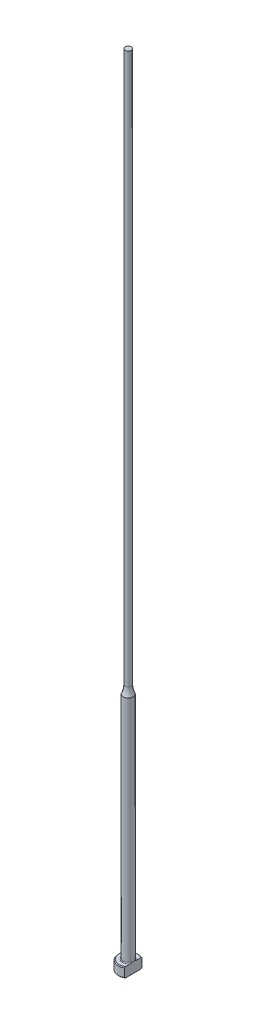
ISO-10303-21;
HEADER;
FILE_DESCRIPTION(('STEP AP214'),'2;1');
FILE_NAME('part.step','',(''),(''),'','','');
FILE_SCHEMA(('AUTOMOTIVE_DESIGN { 1 0 10303 214 1 1 1 1 }'));
ENDSEC;
DATA;
#1=APPLICATION_CONTEXT('core data for automotive mechanical design processes');
#2=APPLICATION_PROTOCOL_DEFINITION('international standard','automotive_design',2000,#1);
#3=PRODUCT_CONTEXT('',#1,'mechanical');
#4=PRODUCT('Part','Part','',(#3));
#5=PRODUCT_RELATED_PRODUCT_CATEGORY('part','',(#4));
#6=PRODUCT_DEFINITION_FORMATION('','',#4);
#7=PRODUCT_DEFINITION_CONTEXT('part definition',#1,'design');
#8=PRODUCT_DEFINITION('design','',#6,#7);
#9=PRODUCT_DEFINITION_SHAPE('','',#8);
#10=(LENGTH_UNIT() NAMED_UNIT(*) SI_UNIT(.MILLI.,.METRE.));
#11=(NAMED_UNIT(*) PLANE_ANGLE_UNIT() SI_UNIT($,.RADIAN.));
#12=(NAMED_UNIT(*) SI_UNIT($,.STERADIAN.) SOLID_ANGLE_UNIT());
#13=UNCERTAINTY_MEASURE_WITH_UNIT(LENGTH_MEASURE(1.E-05),#10,'distance_accuracy_value','');
#14=(GEOMETRIC_REPRESENTATION_CONTEXT(3) GLOBAL_UNCERTAINTY_ASSIGNED_CONTEXT((#13)) GLOBAL_UNIT_ASSIGNED_CONTEXT((#10,
#11,#12)) REPRESENTATION_CONTEXT('',''));
#15=CARTESIAN_POINT('',(0.,0.,0.));
#16=DIRECTION('',(0.,0.,1.));
#17=DIRECTION('',(1.,0.,0.));
#18=AXIS2_PLACEMENT_3D('',#15,#16,#17);
#19=CARTESIAN_POINT('',(-3.17499999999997,3.175,0.));
#20=DIRECTION('',(0.,1.,0.));
#21=DIRECTION('',(0.,0.,1.));
#22=AXIS2_PLACEMENT_3D('',#19,#20,#21);
#23=PLANE('',#22);
#24=CARTESIAN_POINT('',(0.,3.175,0.));
#25=DIRECTION('',(0.,1.,0.));
#26=DIRECTION('',(0.,0.,1.));
#27=AXIS2_PLACEMENT_3D('',#24,#25,#26);
#28=CIRCLE('',#27,2.92099999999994);
#29=CARTESIAN_POINT('',(1.58749999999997,3.175,-2.45195529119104));
#30=VERTEX_POINT('',#29);
#31=CARTESIAN_POINT('',(1.58749999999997,3.175,2.45195529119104));
#32=VERTEX_POINT('',#31);
#33=EDGE_CURVE('E105',#30,#32,#28,.T.);
#34=ORIENTED_EDGE('',*,*,#33,.T.);
#35=DIRECTION('',(0.,0.,1.));
#36=VECTOR('',#35,1.);
#37=CARTESIAN_POINT('',(1.58749999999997,3.17499999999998,2.74963065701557));
#38=LINE('',#37,#36);
#39=CARTESIAN_POINT('',(1.58749999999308,3.175,0.933255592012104));
#40=VERTEX_POINT('',#39);
#41=EDGE_CURVE('E126',#40,#32,#38,.T.);
#42=ORIENTED_EDGE('',*,*,#41,.F.);
#43=CARTESIAN_POINT('',(0.,3.175,0.));
#44=DIRECTION('',(0.,1.,0.));
#45=DIRECTION('',(0.,0.,1.));
#46=AXIS2_PLACEMENT_3D('',#43,#44,#45);
#47=CIRCLE('',#46,1.84149999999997);
#48=CARTESIAN_POINT('',(1.58749999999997,3.17500000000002,-0.933255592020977));
#49=VERTEX_POINT('',#48);
#50=EDGE_CURVE('E11',#40,#49,#47,.F.);
#51=ORIENTED_EDGE('',*,*,#50,.T.);
#52=EDGE_CURVE('E52',#30,#49,#38,.T.);
#53=ORIENTED_EDGE('',*,*,#52,.F.);
#54=EDGE_LOOP('',(#34,#42,#51,#53));
#55=FACE_BOUND('',#54,.T.);
#56=ADVANCED_FACE('F32',(#55),#23,.T.);
#57=CARTESIAN_POINT('',(0.,259.958771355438,0.));
#58=DIRECTION('',(0.,1.,0.));
#59=DIRECTION('',(0.,0.,1.));
#60=AXIS2_PLACEMENT_3D('',#57,#58,#59);
#61=CYLINDRICAL_SURFACE('',#60,3.17499999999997);
#62=CARTESIAN_POINT('',(0.,2.92100000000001,0.));
#63=DIRECTION('',(0.,1.,0.));
#64=DIRECTION('',(0.,0.,1.));
#65=AXIS2_PLACEMENT_3D('',#62,#63,#64);
#66=CIRCLE('',#65,3.17499999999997);
#67=CARTESIAN_POINT('',(1.58749999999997,2.92100000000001,2.74963065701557));
#68=VERTEX_POINT('',#67);
#69=CARTESIAN_POINT('',(1.58749999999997,2.92100000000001,-2.74963065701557));
#70=VERTEX_POINT('',#69);
#71=EDGE_CURVE('E98',#68,#70,#66,.F.);
#72=ORIENTED_EDGE('',*,*,#71,.T.);
#73=DIRECTION('',(0.,-1.,0.));
#74=VECTOR('',#73,1.);
#75=CARTESIAN_POINT('',(1.58749999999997,254.001,-2.74963065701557));
#76=LINE('',#75,#74);
#77=CARTESIAN_POINT('',(1.58749999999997,0.253999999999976,-2.74963065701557));
#78=VERTEX_POINT('',#77);
#79=EDGE_CURVE('E141',#70,#78,#76,.T.);
#80=ORIENTED_EDGE('',*,*,#79,.T.);
#81=CARTESIAN_POINT('',(0.,0.253999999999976,0.));
#82=DIRECTION('',(0.,-1.,0.));
#83=DIRECTION('',(0.,0.,-1.));
#84=AXIS2_PLACEMENT_3D('',#81,#82,#83);
#85=CIRCLE('',#84,3.17499999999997);
#86=CARTESIAN_POINT('',(1.58749999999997,0.253999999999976,2.74963065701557));
#87=VERTEX_POINT('',#86);
#88=EDGE_CURVE('E95',#78,#87,#85,.F.);
#89=ORIENTED_EDGE('',*,*,#88,.T.);
#90=DIRECTION('',(0.,-1.,0.));
#91=VECTOR('',#90,1.);
#92=CARTESIAN_POINT('',(1.58749999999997,254.001,2.74963065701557));
#93=LINE('',#92,#91);
#94=EDGE_CURVE('E88',#68,#87,#93,.T.);
#95=ORIENTED_EDGE('',*,*,#94,.F.);
#96=EDGE_LOOP('',(#72,#80,#89,#95));
#97=FACE_BOUND('',#96,.T.);
#98=ADVANCED_FACE('F191',(#97),#61,.T.);
#99=CARTESIAN_POINT('',(0.,0.,0.));
#100=DIRECTION('',(0.,-1.,0.));
#101=DIRECTION('',(0.,0.,-1.));
#102=AXIS2_PLACEMENT_3D('',#99,#100,#101);
#103=PLANE('',#102);
#104=CARTESIAN_POINT('',(0.,0.,0.));
#105=DIRECTION('',(0.,-1.,0.));
#106=DIRECTION('',(0.,0.,-1.));
#107=AXIS2_PLACEMENT_3D('',#104,#105,#106);
#108=CIRCLE('',#107,2.92100000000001);
#109=CARTESIAN_POINT('',(1.58749999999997,0.,2.45195529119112));
#110=VERTEX_POINT('',#109);
#111=CARTESIAN_POINT('',(1.58749999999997,0.,-2.45195529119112));
#112=VERTEX_POINT('',#111);
#113=EDGE_CURVE('E93',#110,#112,#108,.T.);
#114=ORIENTED_EDGE('',*,*,#113,.T.);
#115=DIRECTION('',(0.,0.,1.));
#116=VECTOR('',#115,1.);
#117=CARTESIAN_POINT('',(1.58749999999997,0.,2.74963065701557));
#118=LINE('',#117,#116);
#119=EDGE_CURVE('E78',#112,#110,#118,.T.);
#120=ORIENTED_EDGE('',*,*,#119,.T.);
#121=EDGE_LOOP('',(#114,#120));
#122=FACE_BOUND('',#121,.T.);
#123=ADVANCED_FACE('F97',(#122),#103,.T.);
#124=CARTESIAN_POINT('',(0.,3.17499999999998,0.));
#125=DIRECTION('',(0.,-1.,0.));
#126=DIRECTION('',(0.,0.,-1.));
#127=AXIS2_PLACEMENT_3D('',#124,#125,#126);
#128=CONICAL_SURFACE('',#127,2.92099999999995,0.785398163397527);
#129=ORIENTED_EDGE('',*,*,#71,.F.);
#130=CARTESIAN_POINT('',(1.58749999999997,-0.16162066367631,-6.0529050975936));
#131=CARTESIAN_POINT('',(1.58749999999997,-0.0288893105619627,-5.91567682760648));
#132=CARTESIAN_POINT('',(1.58749999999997,0.103699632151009,-5.7783103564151));
#133=CARTESIAN_POINT('',(1.58749999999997,0.368508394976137,-5.50321874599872));
#134=CARTESIAN_POINT('',(1.58749999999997,0.500728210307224,-5.36549360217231));
#135=CARTESIAN_POINT('',(1.58749999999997,0.764778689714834,-5.08953516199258));
#136=CARTESIAN_POINT('',(1.58749999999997,0.896609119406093,-4.9513016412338));
#137=CARTESIAN_POINT('',(1.58749999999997,1.15968706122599,-4.67428233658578));
#138=CARTESIAN_POINT('',(1.58749999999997,1.29093457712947,-4.53549655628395));
#139=CARTESIAN_POINT('',(1.58749999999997,1.55007705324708,-4.25997724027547));
#140=CARTESIAN_POINT('',(1.58749999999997,1.67798684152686,-4.12325766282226));
#141=CARTESIAN_POINT('',(1.58749999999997,1.9328486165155,-3.84892898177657));
#142=CARTESIAN_POINT('',(1.58749999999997,2.05980060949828,-3.71131988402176));
#143=CARTESIAN_POINT('',(1.58749999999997,2.31237508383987,-3.43493978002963));
#144=CARTESIAN_POINT('',(1.58749999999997,2.43799784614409,-3.29616903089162));
#145=CARTESIAN_POINT('',(1.58749999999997,2.68741369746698,-3.01699558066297));
#146=CARTESIAN_POINT('',(1.58749999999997,2.81120686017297,-2.8765929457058));
#147=CARTESIAN_POINT('',(1.58749999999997,3.00875865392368,-2.64816703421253));
#148=CARTESIAN_POINT('',(1.58749999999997,3.08336151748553,-2.56087478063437));
#149=CARTESIAN_POINT('',(1.58749999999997,3.2312387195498,-2.38515423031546));
#150=CARTESIAN_POINT('',(1.58749999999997,3.30451292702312,-2.29672582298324));
#151=CARTESIAN_POINT('',(1.58749999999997,3.45004422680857,-2.1174740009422));
#152=CARTESIAN_POINT('',(1.58749999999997,3.5222823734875,-2.02663514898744));
#153=CARTESIAN_POINT('',(1.58749999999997,3.66423097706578,-1.8430252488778));
#154=CARTESIAN_POINT('',(1.58749999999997,3.73394203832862,-1.75025467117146));
#155=CARTESIAN_POINT('',(1.58749999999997,3.87080633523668,-1.5606747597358));
#156=CARTESIAN_POINT('',(1.58749999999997,3.93790459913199,-1.46382547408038));
#157=CARTESIAN_POINT('',(1.58749999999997,4.06669147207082,-1.26632594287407));
#158=CARTESIAN_POINT('',(1.58749999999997,4.1283726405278,-1.16567073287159));
#159=CARTESIAN_POINT('',(1.58749999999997,4.21402252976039,-1.01165766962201));
#160=CARTESIAN_POINT('',(1.58749999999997,4.24127929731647,-0.960142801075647));
#161=CARTESIAN_POINT('',(1.58749999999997,4.2930979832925,-0.855780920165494));
#162=CARTESIAN_POINT('',(1.58749999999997,4.31765941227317,-0.802933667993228));
#163=CARTESIAN_POINT('',(1.58749999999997,4.38614656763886,-0.642461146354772));
#164=CARTESIAN_POINT('',(1.58749999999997,4.42510149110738,-0.532518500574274));
#165=CARTESIAN_POINT('',(1.58749999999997,4.46726244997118,-0.367680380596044));
#166=CARTESIAN_POINT('',(1.58749999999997,4.47844427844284,-0.314802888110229));
#167=CARTESIAN_POINT('',(1.58749999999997,4.49576654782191,-0.208209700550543));
#168=CARTESIAN_POINT('',(1.58749999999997,4.50190743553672,-0.154494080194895));
#169=CARTESIAN_POINT('',(1.58749999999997,4.50871296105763,-0.0468792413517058));
#170=CARTESIAN_POINT('',(1.58749999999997,4.5093945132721,0.00701889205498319));
#171=CARTESIAN_POINT('',(1.58749999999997,4.50527679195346,0.114606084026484));
#172=CARTESIAN_POINT('',(1.58749999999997,4.50047706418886,0.168295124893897));
#173=CARTESIAN_POINT('',(1.58749999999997,4.48579689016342,0.27448544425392));
#174=CARTESIAN_POINT('',(1.58749999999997,4.47596081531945,0.32699298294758));
#175=CARTESIAN_POINT('',(1.58749999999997,4.45181809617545,0.430974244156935));
#176=CARTESIAN_POINT('',(1.58749999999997,4.4375096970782,0.482447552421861));
#177=CARTESIAN_POINT('',(1.58749999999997,4.40502489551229,0.584460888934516));
#178=CARTESIAN_POINT('',(1.58749999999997,4.386827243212,0.634994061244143));
#179=CARTESIAN_POINT('',(1.58749999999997,4.34729308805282,0.734789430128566));
#180=CARTESIAN_POINT('',(1.58749999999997,4.3259572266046,0.784051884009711));
#181=CARTESIAN_POINT('',(1.58749999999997,4.25791922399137,0.930549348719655));
#182=CARTESIAN_POINT('',(1.58749999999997,4.20736047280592,1.0259880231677));
#183=CARTESIAN_POINT('',(1.58749999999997,4.0995545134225,1.21304313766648));
#184=CARTESIAN_POINT('',(1.58749999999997,4.04229912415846,1.30465471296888));
#185=CARTESIAN_POINT('',(1.58749999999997,3.92308746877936,1.48526211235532));
#186=CARTESIAN_POINT('',(1.58749999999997,3.86111349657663,1.57424615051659));
#187=CARTESIAN_POINT('',(1.58749999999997,3.73408621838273,1.74990003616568));
#188=CARTESIAN_POINT('',(1.58749999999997,3.66903444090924,1.83657099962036));
#189=CARTESIAN_POINT('',(1.58749999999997,3.53583371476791,2.00931764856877));
#190=CARTESIAN_POINT('',(1.58749999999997,3.46765527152,2.09537048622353));
#191=CARTESIAN_POINT('',(1.58749999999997,3.32960643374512,2.26611736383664));
#192=CARTESIAN_POINT('',(1.58749999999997,3.25973586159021,2.35081125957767));
#193=CARTESIAN_POINT('',(1.58749999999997,3.04858139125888,2.60290121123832));
#194=CARTESIAN_POINT('',(1.58749999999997,2.90542388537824,2.76872537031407));
#195=CARTESIAN_POINT('',(1.58749999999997,2.64069522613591,3.06970913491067));
#196=CARTESIAN_POINT('',(1.58749999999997,2.51959458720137,3.20528660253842));
#197=CARTESIAN_POINT('',(1.58749999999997,2.27590400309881,3.47510321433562));
#198=CARTESIAN_POINT('',(1.58749999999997,2.15331401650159,3.60934232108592));
#199=CARTESIAN_POINT('',(1.58749999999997,1.90694239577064,3.87695374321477));
#200=CARTESIAN_POINT('',(1.58749999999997,1.78315974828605,4.0103251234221));
#201=CARTESIAN_POINT('',(1.58749999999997,1.53478104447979,4.27630880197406));
#202=CARTESIAN_POINT('',(1.58749999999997,1.41018498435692,4.40892109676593));
#203=CARTESIAN_POINT('',(1.58749999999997,1.0457468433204,4.79499418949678));
#204=CARTESIAN_POINT('',(1.58749999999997,0.80507680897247,5.04767313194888));
#205=CARTESIAN_POINT('',(1.58749999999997,0.443121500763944,5.42550911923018));
#206=CARTESIAN_POINT('',(1.58749999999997,0.322378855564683,5.55118772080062));
#207=CARTESIAN_POINT('',(1.58749999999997,0.0805914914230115,5.80225207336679));
#208=CARTESIAN_POINT('',(1.58749999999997,-0.040453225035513,5.92763782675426));
#209=CARTESIAN_POINT('',(1.58749999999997,-0.161620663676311,6.0529050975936));
#210=B_SPLINE_CURVE_WITH_KNOTS('',3,(#130,#131,#132,#133,#134,#135,#136,#137,#138,#139,#140,
#141,#142,#143,#144,#145,#146,#147,#148,#149,#150,#151,#152,#153,#154,#155,#156,#157,#158,#159,
#160,#161,#162,#163,#164,#165,#166,#167,#168,#169,#170,#171,#172,#173,#174,#175,#176,#177,#178,
#179,#180,#181,#182,#183,#184,#185,#186,#187,#188,#189,#190,#191,#192,#193,#194,#195,#196,#197,
#198,#199,#200,#201,#202,#203,#204,#205,#206,#207,#208,#209),.UNSPECIFIED.,.F.,.F.,(4,2,2,2,2,2,
2,2,2,2,2,2,2,2,2,2,2,2,2,2,2,2,2,2,2,2,2,2,2,2,2,2,2,2,2,2,2,2,2,4),(0.,0.572750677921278,
1.14550874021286,1.71856057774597,2.29160869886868,2.85328006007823,3.4149477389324,
3.97649423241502,4.53801804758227,4.88249307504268,5.22700189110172,5.5751532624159,
5.92322081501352,6.27657800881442,6.63041319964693,6.80518126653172,6.9799810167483,
7.3282426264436,7.49018491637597,7.65211285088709,7.81353889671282,7.97497832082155,
8.13501929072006,8.29512313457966,8.45612518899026,8.61709438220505,8.94062993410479,
9.2645649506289,9.58978187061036,9.91483894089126,10.2441741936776,10.5735441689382,
11.2306812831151,11.7760337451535,12.3214014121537,12.8672825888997,13.4131663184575,
14.4600164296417,14.9828595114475,15.5056983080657),.UNSPECIFIED.);
#211=EDGE_CURVE('E118',#32,#68,#210,.T.);
#212=ORIENTED_EDGE('',*,*,#211,.F.);
#213=ORIENTED_EDGE('',*,*,#33,.F.);
#214=EDGE_CURVE('E117',#70,#30,#210,.T.);
#215=ORIENTED_EDGE('',*,*,#214,.F.);
#216=EDGE_LOOP('',(#129,#212,#213,#215));
#217=FACE_BOUND('',#216,.T.);
#218=ADVANCED_FACE('F162',(#217),#128,.T.);
#219=CARTESIAN_POINT('',(0.,0.253999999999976,0.));
#220=DIRECTION('',(0.,1.,0.));
#221=DIRECTION('',(0.,0.,1.));
#222=AXIS2_PLACEMENT_3D('',#219,#220,#221);
#223=CONICAL_SURFACE('',#222,3.17499999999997,0.785398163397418);
#224=ORIENTED_EDGE('',*,*,#88,.F.);
#225=CARTESIAN_POINT('',(1.58749999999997,3.33662066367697,6.0529050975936));
#226=CARTESIAN_POINT('',(1.58749999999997,3.20388931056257,5.91567682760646));
#227=CARTESIAN_POINT('',(1.58749999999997,3.07130036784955,5.77831035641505));
#228=CARTESIAN_POINT('',(1.58749999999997,2.80649160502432,5.50321874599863));
#229=CARTESIAN_POINT('',(1.58749999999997,2.67427178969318,5.3654936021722));
#230=CARTESIAN_POINT('',(1.58749999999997,2.41022131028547,5.08953516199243));
#231=CARTESIAN_POINT('',(1.58749999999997,2.27839088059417,4.95130164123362));
#232=CARTESIAN_POINT('',(1.58749999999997,2.01531293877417,4.67428233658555));
#233=CARTESIAN_POINT('',(1.58749999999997,1.88406542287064,4.5354965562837));
#234=CARTESIAN_POINT('',(1.58749999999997,1.62492294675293,4.25997724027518));
#235=CARTESIAN_POINT('',(1.58749999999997,1.49701315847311,4.12325766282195));
#236=CARTESIAN_POINT('',(1.58749999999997,1.24215138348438,3.84892898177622));
#237=CARTESIAN_POINT('',(1.58749999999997,1.11519939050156,3.71131988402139));
#238=CARTESIAN_POINT('',(1.58749999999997,0.862624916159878,3.43493978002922));
#239=CARTESIAN_POINT('',(1.58749999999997,0.737002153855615,3.29616903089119));
#240=CARTESIAN_POINT('',(1.58749999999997,0.487586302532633,3.01699558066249));
#241=CARTESIAN_POINT('',(1.58749999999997,0.363793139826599,2.8765929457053));
#242=CARTESIAN_POINT('',(1.58749999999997,0.166241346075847,2.64816703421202));
#243=CARTESIAN_POINT('',(1.58749999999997,0.0916384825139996,2.56087478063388));
#244=CARTESIAN_POINT('',(1.58749999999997,-0.0562387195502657,2.385154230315));
#245=CARTESIAN_POINT('',(1.58749999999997,-0.129512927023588,2.29672582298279));
#246=CARTESIAN_POINT('',(1.58749999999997,-0.27504422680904,2.11747400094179));
#247=CARTESIAN_POINT('',(1.58749999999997,-0.347282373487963,2.02663514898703));
#248=CARTESIAN_POINT('',(1.58749999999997,-0.489230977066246,1.84302524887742));
#249=CARTESIAN_POINT('',(1.58749999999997,-0.558942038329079,1.7502546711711));
#250=CARTESIAN_POINT('',(1.58749999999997,-0.695806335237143,1.56067475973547));
#251=CARTESIAN_POINT('',(1.58749999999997,-0.762904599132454,1.46382547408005));
#252=CARTESIAN_POINT('',(1.58749999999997,-0.891691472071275,1.26632594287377));
#253=CARTESIAN_POINT('',(1.58749999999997,-0.953372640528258,1.16567073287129));
#254=CARTESIAN_POINT('',(1.58749999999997,-1.03902252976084,1.01165766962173));
#255=CARTESIAN_POINT('',(1.58749999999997,-1.06627929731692,0.960142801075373));
#256=CARTESIAN_POINT('',(1.58749999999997,-1.11809798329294,0.85578092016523));
#257=CARTESIAN_POINT('',(1.58749999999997,-1.14265941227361,0.802933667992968));
#258=CARTESIAN_POINT('',(1.58749999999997,-1.21114656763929,0.642461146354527));
#259=CARTESIAN_POINT('',(1.58749999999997,-1.2501014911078,0.532518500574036));
#260=CARTESIAN_POINT('',(1.58749999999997,-1.29226244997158,0.367680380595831));
#261=CARTESIAN_POINT('',(1.58749999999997,-1.30344427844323,0.314802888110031));
#262=CARTESIAN_POINT('',(1.58749999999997,-1.32076654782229,0.208209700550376));
#263=CARTESIAN_POINT('',(1.58749999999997,-1.3269074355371,0.154494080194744));
#264=CARTESIAN_POINT('',(1.58749999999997,-1.333712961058,0.0468792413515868));
#265=CARTESIAN_POINT('',(1.58749999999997,-1.33439451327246,-0.00701889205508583));
#266=CARTESIAN_POINT('',(1.58749999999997,-1.33027679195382,-0.114606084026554));
#267=CARTESIAN_POINT('',(1.58749999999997,-1.32547706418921,-0.168295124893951));
#268=CARTESIAN_POINT('',(1.58749999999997,-1.31079689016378,-0.274485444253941));
#269=CARTESIAN_POINT('',(1.58749999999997,-1.3009608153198,-0.326992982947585));
#270=CARTESIAN_POINT('',(1.58749999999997,-1.27681809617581,-0.430974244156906));
#271=CARTESIAN_POINT('',(1.58749999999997,-1.26250969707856,-0.482447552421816));
#272=CARTESIAN_POINT('',(1.58749999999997,-1.23002489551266,-0.584460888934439));
#273=CARTESIAN_POINT('',(1.58749999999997,-1.21182724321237,-0.634994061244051));
#274=CARTESIAN_POINT('',(1.58749999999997,-1.1722930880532,-0.734789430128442));
#275=CARTESIAN_POINT('',(1.58749999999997,-1.15095722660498,-0.784051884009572));
#276=CARTESIAN_POINT('',(1.58749999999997,-1.08291922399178,-0.93054934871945));
#277=CARTESIAN_POINT('',(1.58749999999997,-1.03236047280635,-1.02598802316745));
#278=CARTESIAN_POINT('',(1.58749999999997,-0.924554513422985,-1.21304313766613));
#279=CARTESIAN_POINT('',(1.58749999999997,-0.86729912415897,-1.30465471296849));
#280=CARTESIAN_POINT('',(1.58749999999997,-0.748087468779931,-1.48526211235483));
#281=CARTESIAN_POINT('',(1.58749999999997,-0.686113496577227,-1.57424615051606));
#282=CARTESIAN_POINT('',(1.58749999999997,-0.55908621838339,-1.74990003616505));
#283=CARTESIAN_POINT('',(1.58749999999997,-0.494034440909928,-1.83657099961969));
#284=CARTESIAN_POINT('',(1.58749999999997,-0.360833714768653,-2.00931764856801));
#285=CARTESIAN_POINT('',(1.58749999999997,-0.292655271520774,-2.09537048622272));
#286=CARTESIAN_POINT('',(1.58749999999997,-0.154606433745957,-2.26611736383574));
#287=CARTESIAN_POINT('',(1.58749999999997,-0.0847358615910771,-2.35081125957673));
#288=CARTESIAN_POINT('',(1.58749999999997,0.126418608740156,-2.60290121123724));
#289=CARTESIAN_POINT('',(1.58749999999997,0.269576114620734,-2.76872537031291));
#290=CARTESIAN_POINT('',(1.58749999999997,0.534304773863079,-3.06970913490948));
#291=CARTESIAN_POINT('',(1.58749999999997,0.655405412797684,-3.20528660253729));
#292=CARTESIAN_POINT('',(1.58749999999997,0.899095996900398,-3.47510321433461));
#293=CARTESIAN_POINT('',(1.58749999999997,1.02168598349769,-3.60934232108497));
#294=CARTESIAN_POINT('',(1.58749999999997,1.26805760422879,-3.87695374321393));
#295=CARTESIAN_POINT('',(1.58749999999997,1.39184025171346,-4.01032512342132));
#296=CARTESIAN_POINT('',(1.58749999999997,1.64021895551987,-4.2763088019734));
#297=CARTESIAN_POINT('',(1.58749999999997,1.76481501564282,-4.40892109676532));
#298=CARTESIAN_POINT('',(1.58749999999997,2.12925315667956,-4.79499418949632));
#299=CARTESIAN_POINT('',(1.58749999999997,2.36992319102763,-5.04767313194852));
#300=CARTESIAN_POINT('',(1.58749999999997,2.73187849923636,-5.42550911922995));
#301=CARTESIAN_POINT('',(1.58749999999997,2.85262114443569,-5.55118772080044));
#302=CARTESIAN_POINT('',(1.58749999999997,3.09440850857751,-5.8022520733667));
#303=CARTESIAN_POINT('',(1.58749999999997,3.2154532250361,-5.92763782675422));
#304=CARTESIAN_POINT('',(1.58749999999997,3.33662066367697,-6.0529050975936));
#305=B_SPLINE_CURVE_WITH_KNOTS('',3,(#225,#226,#227,#228,#229,#230,#231,#232,#233,#234,#235,
#236,#237,#238,#239,#240,#241,#242,#243,#244,#245,#246,#247,#248,#249,#250,#251,#252,#253,#254,
#255,#256,#257,#258,#259,#260,#261,#262,#263,#264,#265,#266,#267,#268,#269,#270,#271,#272,#273,
#274,#275,#276,#277,#278,#279,#280,#281,#282,#283,#284,#285,#286,#287,#288,#289,#290,#291,#292,
#293,#294,#295,#296,#297,#298,#299,#300,#301,#302,#303,#304),.UNSPECIFIED.,.F.,.F.,(4,2,2,2,2,2,
2,2,2,2,2,2,2,2,2,2,2,2,2,2,2,2,2,2,2,2,2,2,2,2,2,2,2,2,2,2,2,2,2,4),(0.,0.57275067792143,
1.14550874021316,1.71856057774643,2.29160869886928,2.85328006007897,3.41494773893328,
3.97649423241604,4.53801804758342,4.88249307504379,5.2270018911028,5.57515326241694,
5.92322081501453,6.27657800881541,6.63041319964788,6.80518126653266,6.97998101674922,
7.32824262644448,7.49018491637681,7.65211285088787,7.81353889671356,7.97497832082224,
8.1350192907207,8.29512313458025,8.45612518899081,8.61709438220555,8.94062993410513,
9.26456495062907,9.58978187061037,9.91483894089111,10.2441741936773,10.5735441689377,
11.2306812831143,11.776033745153,12.3214014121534,12.8672825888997,13.4131663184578,
14.4600164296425,14.9828595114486,15.505698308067),.UNSPECIFIED.);
#306=EDGE_CURVE('E81',#112,#78,#305,.T.);
#307=ORIENTED_EDGE('',*,*,#306,.F.);
#308=ORIENTED_EDGE('',*,*,#113,.F.);
#309=EDGE_CURVE('E84',#87,#110,#305,.T.);
#310=ORIENTED_EDGE('',*,*,#309,.F.);
#311=EDGE_LOOP('',(#224,#307,#308,#310));
#312=FACE_BOUND('',#311,.T.);
#313=ADVANCED_FACE('F92',(#312),#223,.T.);
#314=CARTESIAN_POINT('',(0.,3.42900000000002,0.));
#315=DIRECTION('',(0.,1.,0.));
#316=DIRECTION('',(0.,0.,1.));
#317=AXIS2_PLACEMENT_3D('',#314,#315,#316);
#318=TOROIDAL_SURFACE('',#317,1.84149999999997,0.254);
#319=CARTESIAN_POINT('',(1.58749999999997,3.42900000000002,0.));
#320=CARTESIAN_POINT('',(1.58749999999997,3.42899942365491,-1.9220514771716E-10));
#321=CARTESIAN_POINT('',(1.58749999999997,3.42899884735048,-1.2261161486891E-07));
#322=CARTESIAN_POINT('',(1.58749999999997,3.42899773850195,-5.09676365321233E-07));
#323=CARTESIAN_POINT('',(1.58749999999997,3.42899720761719,-7.78176328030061E-07));
#324=CARTESIAN_POINT('',(1.58749999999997,3.42899614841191,-1.42307272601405E-06));
#325=CARTESIAN_POINT('',(1.58749999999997,3.42899562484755,-1.80713867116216E-06));
#326=CARTESIAN_POINT('',(1.58749999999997,3.42899463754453,-2.63494846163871E-06));
#327=CARTESIAN_POINT('',(1.58749999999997,3.42899417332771,-3.07814756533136E-06));
#328=CARTESIAN_POINT('',(1.58749999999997,3.42899261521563,-4.66897357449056E-06));
#329=CARTESIAN_POINT('',(1.58749999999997,3.42899159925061,-5.89404908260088E-06));
#330=CARTESIAN_POINT('',(1.58749999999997,3.42898979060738,-8.42427511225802E-06));
#331=CARTESIAN_POINT('',(1.58749999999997,3.42898899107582,-9.7248057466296E-06));
#332=CARTESIAN_POINT('',(1.58749999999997,3.42898598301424,-1.48060601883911E-05));
#333=CARTESIAN_POINT('',(1.58749999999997,3.42898393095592,-1.86838281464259E-05));
#334=CARTESIAN_POINT('',(1.58749999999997,3.42898057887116,-2.63261117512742E-05));
#335=CARTESIAN_POINT('',(1.58749999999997,3.42897922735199,-3.00687417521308E-05));
#336=CARTESIAN_POINT('',(1.58749999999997,3.42897347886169,-4.60276298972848E-05));
#337=CARTESIAN_POINT('',(1.58749999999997,3.42896911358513,-5.8247019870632E-05));
#338=CARTESIAN_POINT('',(1.58749999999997,3.42896211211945,-8.11070097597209E-05));
#339=CARTESIAN_POINT('',(1.58749999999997,3.42895931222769,-9.16953114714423E-05));
#340=CARTESIAN_POINT('',(1.58749999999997,3.42893712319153,-0.000168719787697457));
#341=CARTESIAN_POINT('',(1.58749999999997,3.42890881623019,-0.000232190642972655));
#342=CARTESIAN_POINT('',(1.58749999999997,3.42880276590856,-0.000479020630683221));
#343=CARTESIAN_POINT('',(1.58749999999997,3.42873165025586,-0.00066443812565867));
#344=CARTESIAN_POINT('',(1.58749999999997,3.42845137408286,-0.0013844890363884));
#345=CARTESIAN_POINT('',(1.58749999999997,3.42823526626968,-0.00191701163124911));
#346=CARTESIAN_POINT('',(1.58749999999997,3.42735449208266,-0.00409774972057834));
#347=CARTESIAN_POINT('',(1.58749999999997,3.42669768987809,-0.00574830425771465));
#348=CARTESIAN_POINT('',(1.58749999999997,3.4174405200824,-0.0289985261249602));
#349=CARTESIAN_POINT('',(1.58749999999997,3.40878325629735,-0.0505816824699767));
#350=CARTESIAN_POINT('',(1.58749999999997,3.39189297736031,-0.0929947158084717));
#351=CARTESIAN_POINT('',(1.58749999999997,3.38365605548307,-0.11382315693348));
#352=CARTESIAN_POINT('',(1.58749999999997,3.36635393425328,-0.157956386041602));
#353=CARTESIAN_POINT('',(1.58749999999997,3.35730391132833,-0.181267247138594));
#354=CARTESIAN_POINT('',(1.58749999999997,3.33936775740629,-0.228222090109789));
#355=CARTESIAN_POINT('',(1.58749999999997,3.33048420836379,-0.25186705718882));
#356=CARTESIAN_POINT('',(1.58749999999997,3.30894496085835,-0.310512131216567));
#357=CARTESIAN_POINT('',(1.58749999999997,3.29649449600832,-0.345588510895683));
#358=CARTESIAN_POINT('',(1.58749999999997,3.27296975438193,-0.415278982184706));
#359=CARTESIAN_POINT('',(1.58749999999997,3.26186987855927,-0.449884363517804));
#360=CARTESIAN_POINT('',(1.58749999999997,3.2395832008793,-0.524471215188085));
#361=CARTESIAN_POINT('',(1.58749999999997,3.22860862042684,-0.564517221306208));
#362=CARTESIAN_POINT('',(1.58749999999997,3.20902534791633,-0.645529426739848));
#363=CARTESIAN_POINT('',(1.58749999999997,3.20043582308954,-0.686500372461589));
#364=CARTESIAN_POINT('',(1.58749999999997,3.18611712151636,-0.771546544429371));
#365=CARTESIAN_POINT('',(1.58749999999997,3.18059550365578,-0.815658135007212));
#366=CARTESIAN_POINT('',(1.58749999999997,3.17455396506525,-0.904117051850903));
#367=CARTESIAN_POINT('',(1.58749999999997,3.17401361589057,-0.948462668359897));
#368=CARTESIAN_POINT('',(1.58749999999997,3.17898948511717,-1.02531896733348));
#369=CARTESIAN_POINT('',(1.58749999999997,3.1829739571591,-1.05792141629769));
#370=CARTESIAN_POINT('',(1.58749999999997,3.19569167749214,-1.12184393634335));
#371=CARTESIAN_POINT('',(1.58749999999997,3.20436049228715,-1.1531753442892));
#372=CARTESIAN_POINT('',(1.58749999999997,3.22236152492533,-1.19946468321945));
#373=CARTESIAN_POINT('',(1.58749999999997,3.2295150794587,-1.21526783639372));
#374=CARTESIAN_POINT('',(1.58749999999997,3.24587062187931,-1.24583726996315));
#375=CARTESIAN_POINT('',(1.58749999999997,3.25507530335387,-1.26060215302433));
#376=CARTESIAN_POINT('',(1.58749999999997,3.27378481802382,-1.28575815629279));
#377=CARTESIAN_POINT('',(1.58749999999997,3.28289001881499,-1.29644383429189));
#378=CARTESIAN_POINT('',(1.58749999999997,3.30268460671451,-1.31623154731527));
#379=CARTESIAN_POINT('',(1.58749999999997,3.31337067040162,-1.32533681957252));
#380=CARTESIAN_POINT('',(1.58749999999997,3.33349977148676,-1.33941140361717));
#381=CARTESIAN_POINT('',(1.58749999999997,3.34261446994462,-1.34484814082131));
#382=CARTESIAN_POINT('',(1.58749999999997,3.36161455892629,-1.35416329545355));
#383=CARTESIAN_POINT('',(1.58749999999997,3.37149946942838,-1.35804267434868));
#384=CARTESIAN_POINT('',(1.58749999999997,3.39188678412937,-1.36398436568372));
#385=CARTESIAN_POINT('',(1.58749999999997,3.40239309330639,-1.36603350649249));
#386=CARTESIAN_POINT('',(1.58749999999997,3.42360372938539,-1.3680840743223));
#387=CARTESIAN_POINT('',(1.58749999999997,3.43430795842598,-1.36808648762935));
#388=CARTESIAN_POINT('',(1.58749999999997,3.45433283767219,-1.36616208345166));
#389=CARTESIAN_POINT('',(1.58749999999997,3.46367506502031,-1.36444960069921));
#390=CARTESIAN_POINT('',(1.58749999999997,3.48195519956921,-1.35953338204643));
#391=CARTESIAN_POINT('',(1.58749999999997,3.49089304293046,-1.3563294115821));
#392=CARTESIAN_POINT('',(1.58749999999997,3.50850302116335,-1.34848006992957));
#393=CARTESIAN_POINT('',(1.58749999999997,3.5171531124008,-1.34378578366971));
#394=CARTESIAN_POINT('',(1.58749999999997,3.53371257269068,-1.33324445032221));
#395=CARTESIAN_POINT('',(1.58749999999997,3.54162163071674,-1.32739692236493));
#396=CARTESIAN_POINT('',(1.58749999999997,3.56107121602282,-1.31107304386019));
#397=CARTESIAN_POINT('',(1.58749999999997,3.57202221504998,-1.29989286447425));
#398=CARTESIAN_POINT('',(1.58749999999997,3.59202509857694,-1.27593566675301));
#399=CARTESIAN_POINT('',(1.58749999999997,3.60107086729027,-1.26315370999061));
#400=CARTESIAN_POINT('',(1.58749999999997,3.62186023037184,-1.22930733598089));
#401=CARTESIAN_POINT('',(1.58749999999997,3.63240584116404,-1.20751096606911));
#402=CARTESIAN_POINT('',(1.58749999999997,3.65004643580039,-1.16266144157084));
#403=CARTESIAN_POINT('',(1.58749999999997,3.65714435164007,-1.13960937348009));
#404=CARTESIAN_POINT('',(1.58749999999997,3.67265428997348,-1.07603916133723));
#405=CARTESIAN_POINT('',(1.58749999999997,3.67834921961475,-1.03486686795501));
#406=CARTESIAN_POINT('',(1.58749999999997,3.68382880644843,-0.951558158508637));
#407=CARTESIAN_POINT('',(1.58749999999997,3.68350976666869,-0.909417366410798));
#408=CARTESIAN_POINT('',(1.58749999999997,3.67745397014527,-0.811383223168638));
#409=CARTESIAN_POINT('',(1.58749999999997,3.66993873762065,-0.755610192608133));
#410=CARTESIAN_POINT('',(1.58749999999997,3.64933373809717,-0.644937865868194));
#411=CARTESIAN_POINT('',(1.58749999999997,3.63621897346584,-0.59004364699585));
#412=CARTESIAN_POINT('',(1.58749999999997,3.60740922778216,-0.485757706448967));
#413=CARTESIAN_POINT('',(1.58749999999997,3.59201096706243,-0.436281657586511));
#414=CARTESIAN_POINT('',(1.58749999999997,3.55922497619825,-0.338551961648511));
#415=CARTESIAN_POINT('',(1.58749999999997,3.5418584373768,-0.290291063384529));
#416=CARTESIAN_POINT('',(1.58749999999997,3.51760237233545,-0.225557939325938));
#417=CARTESIAN_POINT('',(1.58749999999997,3.51126413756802,-0.208874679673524));
#418=CARTESIAN_POINT('',(1.58749999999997,3.49830042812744,-0.17512392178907));
#419=CARTESIAN_POINT('',(1.58749999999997,3.49167176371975,-0.158057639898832));
#420=CARTESIAN_POINT('',(1.58749999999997,3.47585523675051,-0.117638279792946));
#421=CARTESIAN_POINT('',(1.58749999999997,3.46662970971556,-0.0943002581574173));
#422=CARTESIAN_POINT('',(1.58749999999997,3.44889695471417,-0.0497824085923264));
#423=CARTESIAN_POINT('',(1.58749999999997,3.44040039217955,-0.028598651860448));
#424=CARTESIAN_POINT('',(1.58749999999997,3.43130364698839,-0.00575168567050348));
#425=CARTESIAN_POINT('',(1.58749999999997,3.43064818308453,-0.00410451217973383));
#426=CARTESIAN_POINT('',(1.58749999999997,3.42976776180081,-0.00192459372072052));
#427=CARTESIAN_POINT('',(1.58749999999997,3.42955062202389,-0.00138952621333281));
#428=CARTESIAN_POINT('',(1.58749999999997,3.42926908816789,-0.000666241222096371));
#429=CARTESIAN_POINT('',(1.58749999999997,3.42919771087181,-0.000480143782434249));
#430=CARTESIAN_POINT('',(1.58749999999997,3.42909131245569,-0.000232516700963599));
#431=CARTESIAN_POINT('',(1.58749999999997,3.42906294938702,-0.000168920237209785));
#432=CARTESIAN_POINT('',(1.58749999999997,3.42904072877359,-9.17527162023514E-05));
#433=CARTESIAN_POINT('',(1.58749999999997,3.42903792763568,-8.11550293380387E-05));
#434=CARTESIAN_POINT('',(1.58749999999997,3.42903091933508,-5.82743948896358E-05));
#435=CARTESIAN_POINT('',(1.58749999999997,3.42902654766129,-4.60440001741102E-05));
#436=CARTESIAN_POINT('',(1.58749999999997,3.42902079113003,-3.00727682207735E-05));
#437=CARTESIAN_POINT('',(1.58749999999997,3.42901943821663,-2.63286807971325E-05));
#438=CARTESIAN_POINT('',(1.58749999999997,3.42901608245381,-1.86836529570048E-05));
#439=CARTESIAN_POINT('',(1.58749999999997,3.4290140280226,-1.48046517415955E-05));
#440=CARTESIAN_POINT('',(1.58749999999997,3.42901101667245,-9.72223943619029E-06));
#441=CARTESIAN_POINT('',(1.58749999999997,3.42901021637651,-8.42159649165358E-06));
#442=CARTESIAN_POINT('',(1.58749999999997,3.42900840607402,-5.89129729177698E-06));
#443=CARTESIAN_POINT('',(1.58749999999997,3.42900738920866,-4.66626867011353E-06));
#444=CARTESIAN_POINT('',(1.58749999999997,3.42900582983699,-3.07568803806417E-06));
#445=CARTESIAN_POINT('',(1.58749999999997,3.42900536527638,-2.63259565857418E-06));
#446=CARTESIAN_POINT('',(1.58749999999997,3.4290043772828,-1.80506085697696E-06));
#447=CARTESIAN_POINT('',(1.58749999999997,3.42900385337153,-1.42116387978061E-06));
#448=CARTESIAN_POINT('',(1.58749999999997,3.42900279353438,-7.76675643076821E-07));
#449=CARTESIAN_POINT('',(1.58749999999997,3.42900226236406,-5.08406487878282E-07));
#450=CARTESIAN_POINT('',(1.58749999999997,3.42900115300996,-1.21901887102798E-07));
#451=CARTESIAN_POINT('',(1.58749999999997,3.42900057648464,1.92251677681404E-10));
#452=CARTESIAN_POINT('',(1.58749999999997,3.42900000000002,0.));
#453=B_SPLINE_CURVE_WITH_KNOTS('',3,(#319,#320,#321,#322,#323,#324,#325,#326,#327,#328,#329,
#330,#331,#332,#333,#334,#335,#336,#337,#338,#339,#340,#341,#342,#343,#344,#345,#346,#347,#348,
#349,#350,#351,#352,#353,#354,#355,#356,#357,#358,#359,#360,#361,#362,#363,#364,#365,#366,#367,
#368,#369,#370,#371,#372,#373,#374,#375,#376,#377,#378,#379,#380,#381,#382,#383,#384,#385,#386,
#387,#388,#389,#390,#391,#392,#393,#394,#395,#396,#397,#398,#399,#400,#401,#402,#403,#404,#405,
#406,#407,#408,#409,#410,#411,#412,#413,#414,#415,#416,#417,#418,#419,#420,#421,#422,#423,#424,
#425,#426,#427,#428,#429,#430,#431,#432,#433,#434,#435,#436,#437,#438,#439,#440,#441,#442,#443,
#444,#445,#446,#447,#448,#449,#450,#451,#452),.UNSPECIFIED.,.T.,.F.,(4,2,2,2,2,2,2,2,2,2,2,2,2,
2,2,2,2,2,2,2,2,2,2,2,2,2,2,2,2,2,2,2,2,2,2,2,2,2,2,2,2,2,2,2,2,2,2,2,2,2,2,2,2,2,2,2,2,2,2,2,2,
2,2,2,2,2,4),(0.,1.72815458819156E-06,3.50429255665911E-06,5.44431004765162E-06,
7.3675525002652E-06,1.2119089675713E-05,1.66953775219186E-05,2.98160400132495E-05,
4.17409564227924E-05,8.0660475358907E-05,0.000113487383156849,0.000321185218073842,
0.000917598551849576,0.00264089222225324,0.00797105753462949,0.0777276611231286,
0.144923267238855,0.219939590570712,0.295714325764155,0.407362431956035,0.516367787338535,
0.640878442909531,0.766362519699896,0.899536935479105,1.03216495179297,1.13045740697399,
1.22743103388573,1.27935899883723,1.33135556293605,1.37333248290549,1.41522237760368,
1.44693946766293,1.47863694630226,1.51056074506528,1.54246916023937,1.57083210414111,
1.59919951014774,1.62861579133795,1.65804436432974,1.70472658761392,1.75155645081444,
1.82378709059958,1.89595619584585,2.01995471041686,2.1460932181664,2.31447224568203,
2.48361094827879,2.6389891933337,2.79283011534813,2.84637031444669,2.9012946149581,
2.97658236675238,3.04504771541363,3.05036697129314,3.05209849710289,3.05269709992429,
3.05290520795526,3.05293806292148,3.05297701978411,3.05298895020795,3.05300207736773,
3.05300665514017,3.0530114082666,3.05301333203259,3.05301527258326,3.05301704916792,
3.05301877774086),.UNSPECIFIED.);
#454=CARTESIAN_POINT('',(1.58749999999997,3.42900000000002,0.));
#455=VERTEX_POINT('',#454);
#456=EDGE_CURVE('E47',#455,#49,#453,.T.);
#457=ORIENTED_EDGE('',*,*,#456,.T.);
#458=ORIENTED_EDGE('',*,*,#50,.F.);
#459=CARTESIAN_POINT('',(1.58749999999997,3.42900000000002,0.));
#460=CARTESIAN_POINT('',(1.58749999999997,3.42900057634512,1.9220512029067E-10));
#461=CARTESIAN_POINT('',(1.58749999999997,3.42900115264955,1.22611614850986E-07));
#462=CARTESIAN_POINT('',(1.58749999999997,3.42900226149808,5.09676365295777E-07));
#463=CARTESIAN_POINT('',(1.58749999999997,3.42900279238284,7.78176328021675E-07));
#464=CARTESIAN_POINT('',(1.58749999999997,3.42900385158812,1.42307272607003E-06));
#465=CARTESIAN_POINT('',(1.58749999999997,3.42900437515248,1.80713867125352E-06));
#466=CARTESIAN_POINT('',(1.58749999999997,3.4290053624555,2.63494846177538E-06));
#467=CARTESIAN_POINT('',(1.58749999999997,3.42900582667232,3.0781475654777E-06));
#468=CARTESIAN_POINT('',(1.58749999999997,3.4290073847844,4.66897357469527E-06));
#469=CARTESIAN_POINT('',(1.58749999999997,3.42900840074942,5.89404908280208E-06));
#470=CARTESIAN_POINT('',(1.58749999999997,3.42901020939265,8.42427511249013E-06));
#471=CARTESIAN_POINT('',(1.58749999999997,3.42901100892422,9.72480574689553E-06));
#472=CARTESIAN_POINT('',(1.58749999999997,3.42901401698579,1.48060601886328E-05));
#473=CARTESIAN_POINT('',(1.58749999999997,3.42901606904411,1.86838281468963E-05));
#474=CARTESIAN_POINT('',(1.58749999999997,3.42901942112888,2.63261117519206E-05));
#475=CARTESIAN_POINT('',(1.58749999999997,3.42902077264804,3.00687417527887E-05));
#476=CARTESIAN_POINT('',(1.58749999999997,3.42902652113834,4.60276298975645E-05));
#477=CARTESIAN_POINT('',(1.58749999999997,3.4290308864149,5.82470198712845E-05));
#478=CARTESIAN_POINT('',(1.58749999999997,3.42903788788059,8.11070097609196E-05));
#479=CARTESIAN_POINT('',(1.58749999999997,3.42904068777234,9.16953114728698E-05));
#480=CARTESIAN_POINT('',(1.58749999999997,3.4290628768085,0.000168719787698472));
#481=CARTESIAN_POINT('',(1.58749999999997,3.42909118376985,0.000232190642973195));
#482=CARTESIAN_POINT('',(1.58749999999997,3.42919723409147,0.000479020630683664));
#483=CARTESIAN_POINT('',(1.58749999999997,3.42926834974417,0.000664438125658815));
#484=CARTESIAN_POINT('',(1.58749999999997,3.42954862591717,0.00138448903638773));
#485=CARTESIAN_POINT('',(1.58749999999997,3.42976473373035,0.00191701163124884));
#486=CARTESIAN_POINT('',(1.58749999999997,3.43064550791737,0.00409774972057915));
#487=CARTESIAN_POINT('',(1.58749999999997,3.43130231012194,0.00574830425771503));
#488=CARTESIAN_POINT('',(1.58749999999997,3.44055947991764,0.0289985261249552));
#489=CARTESIAN_POINT('',(1.58749999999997,3.44921674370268,0.0505816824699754));
#490=CARTESIAN_POINT('',(1.58749999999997,3.46610702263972,0.0929947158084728));
#491=CARTESIAN_POINT('',(1.58749999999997,3.47434394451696,0.11382315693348));
#492=CARTESIAN_POINT('',(1.58749999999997,3.49164606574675,0.157956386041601));
#493=CARTESIAN_POINT('',(1.58749999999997,3.5006960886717,0.181267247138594));
#494=CARTESIAN_POINT('',(1.58749999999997,3.51863224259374,0.228222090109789));
#495=CARTESIAN_POINT('',(1.58749999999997,3.52751579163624,0.25186705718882));
#496=CARTESIAN_POINT('',(1.58749999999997,3.54905503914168,0.310512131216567));
#497=CARTESIAN_POINT('',(1.58749999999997,3.56150550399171,0.345588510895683));
#498=CARTESIAN_POINT('',(1.58749999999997,3.5850302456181,0.415278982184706));
#499=CARTESIAN_POINT('',(1.58749999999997,3.59613012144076,0.449884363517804));
#500=CARTESIAN_POINT('',(1.58749999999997,3.61841679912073,0.524471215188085));
#501=CARTESIAN_POINT('',(1.58749999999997,3.62939137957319,0.564517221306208));
#502=CARTESIAN_POINT('',(1.58749999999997,3.6489746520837,0.645529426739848));
#503=CARTESIAN_POINT('',(1.58749999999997,3.65756417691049,0.686500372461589));
#504=CARTESIAN_POINT('',(1.58749999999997,3.67188287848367,0.771546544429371));
#505=CARTESIAN_POINT('',(1.58749999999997,3.67740449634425,0.815658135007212));
#506=CARTESIAN_POINT('',(1.58749999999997,3.68344603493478,0.904117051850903));
#507=CARTESIAN_POINT('',(1.58749999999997,3.68398638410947,0.948462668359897));
#508=CARTESIAN_POINT('',(1.58749999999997,3.67901051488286,1.02531896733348));
#509=CARTESIAN_POINT('',(1.58749999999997,3.67502604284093,1.05792141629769));
#510=CARTESIAN_POINT('',(1.58749999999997,3.66230832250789,1.12184393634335));
#511=CARTESIAN_POINT('',(1.58749999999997,3.65363950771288,1.1531753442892));
#512=CARTESIAN_POINT('',(1.58749999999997,3.6356384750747,1.19946468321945));
#513=CARTESIAN_POINT('',(1.58749999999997,3.62848492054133,1.21526783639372));
#514=CARTESIAN_POINT('',(1.58749999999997,3.61212937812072,1.24583726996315));
#515=CARTESIAN_POINT('',(1.58749999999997,3.60292469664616,1.26060215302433));
#516=CARTESIAN_POINT('',(1.58749999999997,3.58421518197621,1.28575815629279));
#517=CARTESIAN_POINT('',(1.58749999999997,3.57510998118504,1.29644383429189));
#518=CARTESIAN_POINT('',(1.58749999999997,3.55531539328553,1.31623154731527));
#519=CARTESIAN_POINT('',(1.58749999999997,3.54462932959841,1.32533681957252));
#520=CARTESIAN_POINT('',(1.58749999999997,3.52450022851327,1.33941140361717));
#521=CARTESIAN_POINT('',(1.58749999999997,3.51538553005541,1.34484814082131));
#522=CARTESIAN_POINT('',(1.58749999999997,3.49638544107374,1.35416329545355));
#523=CARTESIAN_POINT('',(1.58749999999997,3.48650053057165,1.35804267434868));
#524=CARTESIAN_POINT('',(1.58749999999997,3.46611321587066,1.36398436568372));
#525=CARTESIAN_POINT('',(1.58749999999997,3.45560690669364,1.36603350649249));
#526=CARTESIAN_POINT('',(1.58749999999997,3.43439627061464,1.3680840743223));
#527=CARTESIAN_POINT('',(1.58749999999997,3.42369204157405,1.36808648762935));
#528=CARTESIAN_POINT('',(1.58749999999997,3.40366716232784,1.36616208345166));
#529=CARTESIAN_POINT('',(1.58749999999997,3.39432493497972,1.36444960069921));
#530=CARTESIAN_POINT('',(1.58749999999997,3.37604480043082,1.35953338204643));
#531=CARTESIAN_POINT('',(1.58749999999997,3.36710695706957,1.3563294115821));
#532=CARTESIAN_POINT('',(1.58749999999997,3.34949697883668,1.34848006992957));
#533=CARTESIAN_POINT('',(1.58749999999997,3.34084688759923,1.34378578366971));
#534=CARTESIAN_POINT('',(1.58749999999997,3.32428742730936,1.33324445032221));
#535=CARTESIAN_POINT('',(1.58749999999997,3.31637836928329,1.32739692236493));
#536=CARTESIAN_POINT('',(1.58749999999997,3.29692878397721,1.31107304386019));
#537=CARTESIAN_POINT('',(1.58749999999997,3.28597778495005,1.29989286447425));
#538=CARTESIAN_POINT('',(1.58749999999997,3.26597490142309,1.27593566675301));
#539=CARTESIAN_POINT('',(1.58749999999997,3.25692913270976,1.26315370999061));
#540=CARTESIAN_POINT('',(1.58749999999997,3.23613976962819,1.22930733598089));
#541=CARTESIAN_POINT('',(1.58749999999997,3.22559415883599,1.20751096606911));
#542=CARTESIAN_POINT('',(1.58749999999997,3.20795356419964,1.16266144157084));
#543=CARTESIAN_POINT('',(1.58749999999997,3.20085564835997,1.13960937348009));
#544=CARTESIAN_POINT('',(1.58749999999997,3.18534571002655,1.07603916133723));
#545=CARTESIAN_POINT('',(1.58749999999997,3.17965078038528,1.03486686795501));
#546=CARTESIAN_POINT('',(1.58749999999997,3.1741711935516,0.951558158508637));
#547=CARTESIAN_POINT('',(1.58749999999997,3.17449023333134,0.909417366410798));
#548=CARTESIAN_POINT('',(1.58749999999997,3.18054602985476,0.811383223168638));
#549=CARTESIAN_POINT('',(1.58749999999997,3.18806126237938,0.755610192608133));
#550=CARTESIAN_POINT('',(1.58749999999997,3.20866626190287,0.644937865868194));
#551=CARTESIAN_POINT('',(1.58749999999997,3.2217810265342,0.59004364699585));
#552=CARTESIAN_POINT('',(1.58749999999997,3.25059077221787,0.485757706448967));
#553=CARTESIAN_POINT('',(1.58749999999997,3.2659890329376,0.43628165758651));
#554=CARTESIAN_POINT('',(1.58749999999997,3.29877502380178,0.338551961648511));
#555=CARTESIAN_POINT('',(1.58749999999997,3.31614156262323,0.290291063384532));
#556=CARTESIAN_POINT('',(1.58749999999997,3.34039762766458,0.225557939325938));
#557=CARTESIAN_POINT('',(1.58749999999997,3.346735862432,0.208874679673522));
#558=CARTESIAN_POINT('',(1.58749999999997,3.35969957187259,0.175123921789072));
#559=CARTESIAN_POINT('',(1.58749999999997,3.3663282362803,0.15805763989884));
#560=CARTESIAN_POINT('',(1.58749999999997,3.3821447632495,0.117638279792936));
#561=CARTESIAN_POINT('',(1.58749999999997,3.39137029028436,0.0943002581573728));
#562=CARTESIAN_POINT('',(1.58749999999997,3.40910304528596,0.0497824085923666));
#563=CARTESIAN_POINT('',(1.58749999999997,3.41759960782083,0.0285986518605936));
#564=CARTESIAN_POINT('',(1.58749999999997,3.42669635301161,0.00575168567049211));
#565=CARTESIAN_POINT('',(1.58749999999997,3.42735181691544,0.00410451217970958));
#566=CARTESIAN_POINT('',(1.58749999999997,3.42823223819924,0.00192459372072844));
#567=CARTESIAN_POINT('',(1.58749999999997,3.42844937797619,0.00138952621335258));
#568=CARTESIAN_POINT('',(1.58749999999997,3.42873091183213,0.000666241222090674));
#569=CARTESIAN_POINT('',(1.58749999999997,3.42880228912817,0.000480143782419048));
#570=CARTESIAN_POINT('',(1.58749999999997,3.42890868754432,0.000232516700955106));
#571=CARTESIAN_POINT('',(1.58749999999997,3.42893705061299,0.000168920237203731));
#572=CARTESIAN_POINT('',(1.58749999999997,3.42895927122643,9.17527161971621E-05));
#573=CARTESIAN_POINT('',(1.58749999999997,3.42896207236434,8.1155029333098E-05));
#574=CARTESIAN_POINT('',(1.58749999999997,3.42896908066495,5.82743948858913E-05));
#575=CARTESIAN_POINT('',(1.58749999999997,3.42897345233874,4.60440001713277E-05));
#576=CARTESIAN_POINT('',(1.58749999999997,3.42897920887,3.00727682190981E-05));
#577=CARTESIAN_POINT('',(1.58749999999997,3.42898056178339,2.63286807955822E-05));
#578=CARTESIAN_POINT('',(1.58749999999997,3.42898391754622,1.86836529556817E-05));
#579=CARTESIAN_POINT('',(1.58749999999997,3.42898597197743,1.48046517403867E-05));
#580=CARTESIAN_POINT('',(1.58749999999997,3.42898898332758,9.72223943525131E-06));
#581=CARTESIAN_POINT('',(1.58749999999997,3.42898978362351,8.42159649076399E-06));
#582=CARTESIAN_POINT('',(1.58749999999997,3.42899159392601,5.89129729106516E-06));
#583=CARTESIAN_POINT('',(1.58749999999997,3.42899261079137,4.66626866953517E-06));
#584=CARTESIAN_POINT('',(1.58749999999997,3.42899417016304,3.0756880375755E-06));
#585=CARTESIAN_POINT('',(1.58749999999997,3.42899463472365,2.63259565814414E-06));
#586=CARTESIAN_POINT('',(1.58749999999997,3.42899562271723,1.80506085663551E-06));
#587=CARTESIAN_POINT('',(1.58749999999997,3.42899614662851,1.42116387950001E-06));
#588=CARTESIAN_POINT('',(1.58749999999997,3.42899720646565,7.7667564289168E-07));
#589=CARTESIAN_POINT('',(1.58749999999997,3.42899773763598,5.0840648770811E-07));
#590=CARTESIAN_POINT('',(1.58749999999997,3.42899884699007,1.21901887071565E-07));
#591=CARTESIAN_POINT('',(1.58749999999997,3.42899942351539,-1.92251650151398E-10));
#592=CARTESIAN_POINT('',(1.58749999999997,3.42900000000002,0.));
#593=B_SPLINE_CURVE_WITH_KNOTS('',3,(#459,#460,#461,#462,#463,#464,#465,#466,#467,#468,#469,
#470,#471,#472,#473,#474,#475,#476,#477,#478,#479,#480,#481,#482,#483,#484,#485,#486,#487,#488,
#489,#490,#491,#492,#493,#494,#495,#496,#497,#498,#499,#500,#501,#502,#503,#504,#505,#506,#507,
#508,#509,#510,#511,#512,#513,#514,#515,#516,#517,#518,#519,#520,#521,#522,#523,#524,#525,#526,
#527,#528,#529,#530,#531,#532,#533,#534,#535,#536,#537,#538,#539,#540,#541,#542,#543,#544,#545,
#546,#547,#548,#549,#550,#551,#552,#553,#554,#555,#556,#557,#558,#559,#560,#561,#562,#563,#564,
#565,#566,#567,#568,#569,#570,#571,#572,#573,#574,#575,#576,#577,#578,#579,#580,#581,#582,#583,
#584,#585,#586,#587,#588,#589,#590,#591,#592),.UNSPECIFIED.,.T.,.F.,(4,2,2,2,2,2,2,2,2,2,2,2,2,
2,2,2,2,2,2,2,2,2,2,2,2,2,2,2,2,2,2,2,2,2,2,2,2,2,2,2,2,2,2,2,2,2,2,2,2,2,2,2,2,2,2,2,2,2,2,2,2,
2,2,2,2,2,4),(0.,1.72815458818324E-06,3.50429255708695E-06,5.44431004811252E-06,
7.36755250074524E-06,1.21190896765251E-05,1.66953775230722E-05,2.98160400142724E-05,
4.17409564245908E-05,8.06604753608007E-05,0.000113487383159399,0.000321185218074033,
0.000917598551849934,0.00264089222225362,0.00797105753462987,0.077727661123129,
0.144923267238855,0.219939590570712,0.295714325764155,0.407362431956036,0.516367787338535,
0.640878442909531,0.766362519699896,0.899536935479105,1.03216495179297,1.13045740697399,
1.22743103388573,1.27935899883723,1.33135556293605,1.37333248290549,1.41522237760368,
1.44693946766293,1.47863694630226,1.51056074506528,1.54246916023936,1.57083210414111,
1.59919951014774,1.62861579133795,1.65804436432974,1.70472658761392,1.75155645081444,
1.82378709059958,1.89595619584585,2.01995471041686,2.1460932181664,2.31447224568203,
2.48361094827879,2.6389891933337,2.79283011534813,2.84637031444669,2.9012946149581,
2.97658236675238,3.04504771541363,3.05036697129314,3.05209849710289,3.05269709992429,
3.05290520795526,3.05293806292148,3.05297701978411,3.05298895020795,3.05300207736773,
3.05300665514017,3.0530114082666,3.05301333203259,3.05301527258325,3.05301704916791,
3.05301877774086),.UNSPECIFIED.);
#594=EDGE_CURVE('E147',#40,#455,#593,.T.);
#595=ORIENTED_EDGE('',*,*,#594,.T.);
#596=CARTESIAN_POINT('',(0.,3.42900000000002,0.));
#597=DIRECTION('',(0.,1.,0.));
#598=DIRECTION('',(0.,0.,1.));
#599=AXIS2_PLACEMENT_3D('',#596,#597,#598);
#600=CIRCLE('',#599,1.58749999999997);
#601=EDGE_CURVE('E40',#455,#455,#600,.T.);
#602=ORIENTED_EDGE('',*,*,#601,.F.);
#603=EDGE_LOOP('',(#457,#458,#595,#602));
#604=FACE_BOUND('',#603,.T.);
#605=ADVANCED_FACE('F34',(#604),#318,.F.);
#606=CARTESIAN_POINT('',(-0.991869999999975,254.,0.));
#607=DIRECTION('',(0.,1.,0.));
#608=DIRECTION('',(0.,0.,1.));
#609=AXIS2_PLACEMENT_3D('',#606,#607,#608);
#610=PLANE('',#609);
#611=CARTESIAN_POINT('',(0.,254.,0.));
#612=DIRECTION('',(0.,1.,0.));
#613=DIRECTION('',(0.,0.,1.));
#614=AXIS2_PLACEMENT_3D('',#611,#612,#613);
#615=CIRCLE('',#614,0.991869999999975);
#616=CARTESIAN_POINT('',(0.,254.,0.991869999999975));
#617=VERTEX_POINT('',#616);
#618=EDGE_CURVE('E108',#617,#617,#615,.T.);
#619=ORIENTED_EDGE('',*,*,#618,.T.);
#620=EDGE_LOOP('',(#619));
#621=FACE_BOUND('',#620,.T.);
#622=ADVANCED_FACE('F180',(#621),#610,.T.);
#623=CARTESIAN_POINT('',(0.,259.958771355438,0.));
#624=DIRECTION('',(0.,1.,0.));
#625=DIRECTION('',(0.,0.,1.));
#626=AXIS2_PLACEMENT_3D('',#623,#624,#625);
#627=CYLINDRICAL_SURFACE('',#626,0.991869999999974);
#628=CARTESIAN_POINT('',(0.,78.8850932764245,0.));
#629=DIRECTION('',(0.,1.,0.));
#630=DIRECTION('',(0.,0.,1.));
#631=AXIS2_PLACEMENT_3D('',#628,#629,#630);
#632=CIRCLE('',#631,0.991869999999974);
#633=CARTESIAN_POINT('',(0.,78.8850932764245,0.991869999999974));
#634=VERTEX_POINT('',#633);
#635=EDGE_CURVE('E111',#634,#634,#632,.T.);
#636=ORIENTED_EDGE('',*,*,#635,.T.);
#637=EDGE_LOOP('',(#636));
#638=FACE_BOUND('',#637,.T.);
#639=ORIENTED_EDGE('',*,*,#618,.F.);
#640=EDGE_LOOP('',(#639));
#641=FACE_BOUND('',#640,.T.);
#642=ADVANCED_FACE('F174',(#638,#641),#627,.T.);
#643=CARTESIAN_POINT('',(0.,78.8850932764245,0.));
#644=DIRECTION('',(0.,1.,0.));
#645=DIRECTION('',(0.,0.,1.));
#646=AXIS2_PLACEMENT_3D('',#643,#644,#645);
#647=TOROIDAL_SURFACE('',#646,7.34186999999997,6.35);
#648=CARTESIAN_POINT('',(0.,76.2,0.));
#649=DIRECTION('',(0.,1.,0.));
#650=DIRECTION('',(0.,0.,1.));
#651=AXIS2_PLACEMENT_3D('',#648,#649,#650);
#652=CIRCLE('',#651,1.58749999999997);
#653=CARTESIAN_POINT('',(0.,76.2,1.58749999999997));
#654=VERTEX_POINT('',#653);
#655=EDGE_CURVE('E114',#654,#654,#652,.T.);
#656=ORIENTED_EDGE('',*,*,#655,.T.);
#657=EDGE_LOOP('',(#656));
#658=FACE_BOUND('',#657,.T.);
#659=ORIENTED_EDGE('',*,*,#635,.F.);
#660=EDGE_LOOP('',(#659));
#661=FACE_BOUND('',#660,.T.);
#662=ADVANCED_FACE('F168',(#658,#661),#647,.F.);
#663=CARTESIAN_POINT('',(0.,259.958771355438,0.));
#664=DIRECTION('',(0.,1.,0.));
#665=DIRECTION('',(0.,0.,1.));
#666=AXIS2_PLACEMENT_3D('',#663,#664,#665);
#667=CYLINDRICAL_SURFACE('',#666,1.58749999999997);
#668=ORIENTED_EDGE('',*,*,#601,.T.);
#669=EDGE_LOOP('',(#668));
#670=FACE_BOUND('',#669,.T.);
#671=ORIENTED_EDGE('',*,*,#655,.F.);
#672=EDGE_LOOP('',(#671));
#673=FACE_BOUND('',#672,.T.);
#674=ADVANCED_FACE('F165',(#670,#673),#667,.T.);
#675=CARTESIAN_POINT('',(1.58749999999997,254.001,2.74963065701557));
#676=DIRECTION('',(1.,0.,0.));
#677=DIRECTION('',(0.,0.,-1.));
#678=AXIS2_PLACEMENT_3D('',#675,#676,#677);
#679=PLANE('',#678);
#680=ORIENTED_EDGE('',*,*,#309,.T.);
#681=ORIENTED_EDGE('',*,*,#119,.F.);
#682=ORIENTED_EDGE('',*,*,#306,.T.);
#683=ORIENTED_EDGE('',*,*,#79,.F.);
#684=ORIENTED_EDGE('',*,*,#214,.T.);
#685=ORIENTED_EDGE('',*,*,#52,.T.);
#686=ORIENTED_EDGE('',*,*,#456,.F.);
#687=ORIENTED_EDGE('',*,*,#594,.F.);
#688=ORIENTED_EDGE('',*,*,#41,.T.);
#689=ORIENTED_EDGE('',*,*,#211,.T.);
#690=ORIENTED_EDGE('',*,*,#94,.T.);
#691=EDGE_LOOP('',(#680,#681,#682,#683,#684,#685,#686,#687,#688,#689,#690));
#692=FACE_BOUND('',#691,.T.);
#693=ADVANCED_FACE('F80',(#692),#679,.T.);
#694=CLOSED_SHELL('',(#56,#98,#123,#218,#313,#605,#622,#642,#662,#674,#693));
#695=MANIFOLD_SOLID_BREP('B2',#694);
#696=ADVANCED_BREP_SHAPE_REPRESENTATION('',(#18,#695),#14);
#697=SHAPE_DEFINITION_REPRESENTATION(#9,#696);
ENDSEC;
END-ISO-10303-21;
